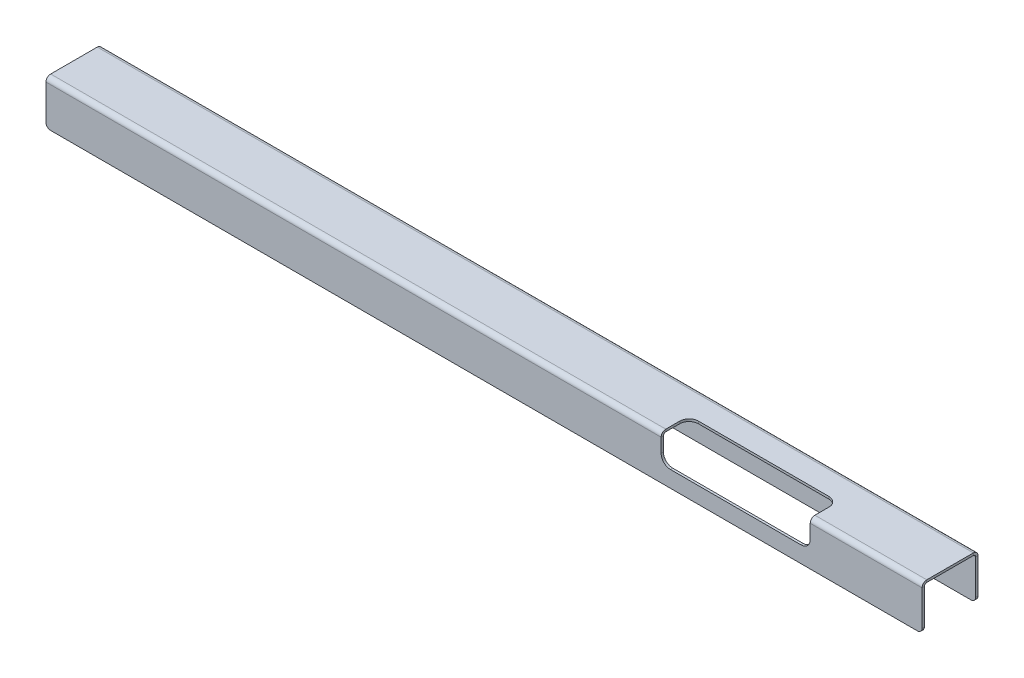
ISO-10303-21;
HEADER;
FILE_DESCRIPTION(('STEP AP214'),'2;1');
FILE_NAME('part.step','',(''),(''),'','','');
FILE_SCHEMA(('AUTOMOTIVE_DESIGN { 1 0 10303 214 1 1 1 1 }'));
ENDSEC;
DATA;
#1=APPLICATION_CONTEXT('core data for automotive mechanical design processes');
#2=APPLICATION_PROTOCOL_DEFINITION('international standard','automotive_design',2000,#1);
#3=PRODUCT_CONTEXT('',#1,'mechanical');
#4=PRODUCT('Part','Part','',(#3));
#5=PRODUCT_RELATED_PRODUCT_CATEGORY('part','',(#4));
#6=PRODUCT_DEFINITION_FORMATION('','',#4);
#7=PRODUCT_DEFINITION_CONTEXT('part definition',#1,'design');
#8=PRODUCT_DEFINITION('design','',#6,#7);
#9=PRODUCT_DEFINITION_SHAPE('','',#8);
#10=(LENGTH_UNIT() NAMED_UNIT(*) SI_UNIT(.MILLI.,.METRE.));
#11=(NAMED_UNIT(*) PLANE_ANGLE_UNIT() SI_UNIT($,.RADIAN.));
#12=(NAMED_UNIT(*) SI_UNIT($,.STERADIAN.) SOLID_ANGLE_UNIT());
#13=UNCERTAINTY_MEASURE_WITH_UNIT(LENGTH_MEASURE(1.E-05),#10,'distance_accuracy_value','');
#14=(GEOMETRIC_REPRESENTATION_CONTEXT(3) GLOBAL_UNCERTAINTY_ASSIGNED_CONTEXT((#13)) GLOBAL_UNIT_ASSIGNED_CONTEXT((#10,
#11,#12)) REPRESENTATION_CONTEXT('',''));
#15=CARTESIAN_POINT('',(0.,0.,0.));
#16=DIRECTION('',(0.,0.,1.));
#17=DIRECTION('',(1.,0.,0.));
#18=AXIS2_PLACEMENT_3D('',#15,#16,#17);
#19=CARTESIAN_POINT('',(419.1,30.1625000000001,19.05));
#20=DIRECTION('',(-1.,0.,0.));
#21=DIRECTION('',(0.,0.,1.));
#22=AXIS2_PLACEMENT_3D('',#19,#20,#21);
#23=PLANE('',#22);
#24=DIRECTION('',(0.,-1.,0.));
#25=VECTOR('',#24,1.);
#26=CARTESIAN_POINT('',(419.1,30.1625000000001,38.1));
#27=LINE('',#26,#25);
#28=CARTESIAN_POINT('',(419.1,26.9875000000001,38.1));
#29=VERTEX_POINT('',#28);
#30=CARTESIAN_POINT('',(419.1,17.4625000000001,38.1));
#31=VERTEX_POINT('',#30);
#32=EDGE_CURVE('E676',#29,#31,#27,.T.);
#33=ORIENTED_EDGE('',*,*,#32,.T.);
#34=DIRECTION('',(0.,0.,1.));
#35=VECTOR('',#34,1.);
#36=CARTESIAN_POINT('',(419.1,17.4625000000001,36.5125000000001));
#37=LINE('',#36,#35);
#38=CARTESIAN_POINT('',(419.1,17.4625000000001,36.5125000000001));
#39=VERTEX_POINT('',#38);
#40=EDGE_CURVE('E463',#31,#39,#37,.F.);
#41=ORIENTED_EDGE('',*,*,#40,.T.);
#42=DIRECTION('',(0.,1.,0.));
#43=VECTOR('',#42,1.);
#44=CARTESIAN_POINT('',(419.1,2.62722613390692E-13,36.5125000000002));
#45=LINE('',#44,#43);
#46=CARTESIAN_POINT('',(419.1,26.9875000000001,36.5125));
#47=VERTEX_POINT('',#46);
#48=EDGE_CURVE('E418',#39,#47,#45,.T.);
#49=ORIENTED_EDGE('',*,*,#48,.T.);
#50=DIRECTION('',(0.,0.,1.));
#51=VECTOR('',#50,1.);
#52=CARTESIAN_POINT('',(419.1,26.9875000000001,36.5125));
#53=LINE('',#52,#51);
#54=EDGE_CURVE('E282',#47,#29,#53,.T.);
#55=ORIENTED_EDGE('',*,*,#54,.T.);
#56=EDGE_LOOP('',(#33,#41,#49,#55));
#57=FACE_BOUND('',#56,.T.);
#58=ADVANCED_FACE('F70',(#57),#23,.F.);
#59=DIRECTION('',(0.,0.,-1.));
#60=VECTOR('',#59,1.);
#61=CARTESIAN_POINT('',(419.1,28.575,-1.00463116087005E-13));
#62=LINE('',#61,#60);
#63=CARTESIAN_POINT('',(419.1,28.5750000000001,34.925));
#64=VERTEX_POINT('',#63);
#65=CARTESIAN_POINT('',(419.1,28.5750000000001,25.4));
#66=VERTEX_POINT('',#65);
#67=EDGE_CURVE('E295',#64,#66,#62,.T.);
#68=ORIENTED_EDGE('',*,*,#67,.T.);
#69=DIRECTION('',(0.,-1.,0.));
#70=VECTOR('',#69,1.);
#71=CARTESIAN_POINT('',(419.1,30.1625000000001,25.4));
#72=LINE('',#71,#70);
#73=CARTESIAN_POINT('',(419.1,30.1625000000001,25.4));
#74=VERTEX_POINT('',#73);
#75=EDGE_CURVE('E264',#66,#74,#72,.F.);
#76=ORIENTED_EDGE('',*,*,#75,.T.);
#77=DIRECTION('',(0.,0.,1.));
#78=VECTOR('',#77,1.);
#79=CARTESIAN_POINT('',(419.1,30.1625000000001,19.05));
#80=LINE('',#79,#78);
#81=CARTESIAN_POINT('',(419.1,30.1625000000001,34.925));
#82=VERTEX_POINT('',#81);
#83=EDGE_CURVE('E257',#74,#82,#80,.T.);
#84=ORIENTED_EDGE('',*,*,#83,.T.);
#85=DIRECTION('',(0.,-1.,0.));
#86=VECTOR('',#85,1.);
#87=CARTESIAN_POINT('',(419.1,30.1625000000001,34.925));
#88=LINE('',#87,#86);
#89=EDGE_CURVE('E261',#82,#64,#88,.T.);
#90=ORIENTED_EDGE('',*,*,#89,.T.);
#91=EDGE_LOOP('',(#68,#76,#84,#90));
#92=FACE_BOUND('',#91,.T.);
#93=ADVANCED_FACE('F260',(#92),#23,.F.);
#94=CARTESIAN_POINT('',(520.7,30.1625000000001,19.05));
#95=DIRECTION('',(1.,0.,0.));
#96=DIRECTION('',(0.,0.,-1.));
#97=AXIS2_PLACEMENT_3D('',#94,#95,#96);
#98=PLANE('',#97);
#99=DIRECTION('',(0.,0.,1.));
#100=VECTOR('',#99,1.);
#101=CARTESIAN_POINT('',(520.7,30.1625000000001,19.05));
#102=LINE('',#101,#100);
#103=CARTESIAN_POINT('',(520.7,30.1625000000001,25.4));
#104=VERTEX_POINT('',#103);
#105=CARTESIAN_POINT('',(520.7,30.1625000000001,34.925));
#106=VERTEX_POINT('',#105);
#107=EDGE_CURVE('E270',#104,#106,#102,.T.);
#108=ORIENTED_EDGE('',*,*,#107,.F.);
#109=DIRECTION('',(0.,1.,0.));
#110=VECTOR('',#109,1.);
#111=CARTESIAN_POINT('',(520.7,28.5750000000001,25.4));
#112=LINE('',#111,#110);
#113=CARTESIAN_POINT('',(520.7,28.5750000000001,25.4));
#114=VERTEX_POINT('',#113);
#115=EDGE_CURVE('E460',#104,#114,#112,.F.);
#116=ORIENTED_EDGE('',*,*,#115,.T.);
#117=DIRECTION('',(0.,0.,1.));
#118=VECTOR('',#117,1.);
#119=CARTESIAN_POINT('',(520.7,28.575,-1.00463116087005E-13));
#120=LINE('',#119,#118);
#121=CARTESIAN_POINT('',(520.7,28.5750000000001,34.925));
#122=VERTEX_POINT('',#121);
#123=EDGE_CURVE('E594',#114,#122,#120,.T.);
#124=ORIENTED_EDGE('',*,*,#123,.T.);
#125=DIRECTION('',(0.,1.,0.));
#126=VECTOR('',#125,1.);
#127=CARTESIAN_POINT('',(520.7,28.5750000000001,34.925));
#128=LINE('',#127,#126);
#129=EDGE_CURVE('E283',#122,#106,#128,.T.);
#130=ORIENTED_EDGE('',*,*,#129,.T.);
#131=EDGE_LOOP('',(#108,#116,#124,#130));
#132=FACE_BOUND('',#131,.T.);
#133=ADVANCED_FACE('F648',(#132),#98,.F.);
#134=DIRECTION('',(0.,-1.,0.));
#135=VECTOR('',#134,1.);
#136=CARTESIAN_POINT('',(520.7,2.62722613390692E-13,36.5125000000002));
#137=LINE('',#136,#135);
#138=CARTESIAN_POINT('',(520.7,26.9875000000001,36.5125));
#139=VERTEX_POINT('',#138);
#140=CARTESIAN_POINT('',(520.7,17.4625000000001,36.5125000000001));
#141=VERTEX_POINT('',#140);
#142=EDGE_CURVE('E425',#139,#141,#137,.T.);
#143=ORIENTED_EDGE('',*,*,#142,.T.);
#144=DIRECTION('',(0.,0.,1.));
#145=VECTOR('',#144,1.);
#146=CARTESIAN_POINT('',(520.7,17.4625000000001,38.1));
#147=LINE('',#146,#145);
#148=CARTESIAN_POINT('',(520.7,17.4625000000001,38.1));
#149=VERTEX_POINT('',#148);
#150=EDGE_CURVE('E441',#141,#149,#147,.T.);
#151=ORIENTED_EDGE('',*,*,#150,.T.);
#152=DIRECTION('',(0.,1.,0.));
#153=VECTOR('',#152,1.);
#154=CARTESIAN_POINT('',(520.7,30.1625000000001,38.1));
#155=LINE('',#154,#153);
#156=CARTESIAN_POINT('',(520.7,26.9875000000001,38.1));
#157=VERTEX_POINT('',#156);
#158=EDGE_CURVE('E684',#149,#157,#155,.T.);
#159=ORIENTED_EDGE('',*,*,#158,.T.);
#160=DIRECTION('',(0.,0.,-1.));
#161=VECTOR('',#160,1.);
#162=CARTESIAN_POINT('',(520.7,26.9875000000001,38.1));
#163=LINE('',#162,#161);
#164=EDGE_CURVE('E433',#157,#139,#163,.T.);
#165=ORIENTED_EDGE('',*,*,#164,.T.);
#166=EDGE_LOOP('',(#143,#151,#159,#165));
#167=FACE_BOUND('',#166,.T.);
#168=ADVANCED_FACE('F667',(#167),#98,.F.);
#169=CARTESIAN_POINT('',(0.,26.9875000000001,34.925));
#170=DIRECTION('',(-1.,0.,0.));
#171=DIRECTION('',(0.,0.,1.));
#172=AXIS2_PLACEMENT_3D('',#169,#170,#171);
#173=CYLINDRICAL_SURFACE('',#172,3.175);
#174=CARTESIAN_POINT('',(520.7,26.9875000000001,34.925));
#175=DIRECTION('',(1.,0.,0.));
#176=DIRECTION('',(0.,0.,-1.));
#177=AXIS2_PLACEMENT_3D('',#174,#175,#176);
#178=CIRCLE('',#177,3.175);
#179=EDGE_CURVE('E590',#157,#106,#178,.F.);
#180=ORIENTED_EDGE('',*,*,#179,.F.);
#181=DIRECTION('',(-1.,0.,0.));
#182=VECTOR('',#181,1.);
#183=CARTESIAN_POINT('',(596.9,26.9875000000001,38.1));
#184=LINE('',#183,#182);
#185=CARTESIAN_POINT('',(596.9,26.9875000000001,38.1));
#186=VERTEX_POINT('',#185);
#187=EDGE_CURVE('E575',#157,#186,#184,.F.);
#188=ORIENTED_EDGE('',*,*,#187,.T.);
#189=CARTESIAN_POINT('',(596.9,26.9875000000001,34.925));
#190=DIRECTION('',(-1.,0.,0.));
#191=DIRECTION('',(0.,0.,1.));
#192=AXIS2_PLACEMENT_3D('',#189,#190,#191);
#193=CIRCLE('',#192,3.175);
#194=CARTESIAN_POINT('',(596.9,30.1625000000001,34.925));
#195=VERTEX_POINT('',#194);
#196=EDGE_CURVE('E304',#195,#186,#193,.F.);
#197=ORIENTED_EDGE('',*,*,#196,.F.);
#198=DIRECTION('',(-1.,0.,0.));
#199=VECTOR('',#198,1.);
#200=CARTESIAN_POINT('',(0.,30.1625000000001,34.925));
#201=LINE('',#200,#199);
#202=EDGE_CURVE('E305',#106,#195,#201,.F.);
#203=ORIENTED_EDGE('',*,*,#202,.F.);
#204=EDGE_LOOP('',(#180,#188,#197,#203));
#205=FACE_BOUND('',#204,.T.);
#206=ADVANCED_FACE('F736',(#205),#173,.T.);
#207=CARTESIAN_POINT('',(0.,26.9875000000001,34.925));
#208=DIRECTION('',(-1.,0.,0.));
#209=DIRECTION('',(0.,0.,1.));
#210=AXIS2_PLACEMENT_3D('',#207,#208,#209);
#211=CYLINDRICAL_SURFACE('',#210,1.5875);
#212=DIRECTION('',(-1.,0.,0.));
#213=VECTOR('',#212,1.);
#214=CARTESIAN_POINT('',(596.9,26.9875000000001,36.5125));
#215=LINE('',#214,#213);
#216=CARTESIAN_POINT('',(596.9,26.9875000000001,36.5125));
#217=VERTEX_POINT('',#216);
#218=EDGE_CURVE('E555',#217,#139,#215,.T.);
#219=ORIENTED_EDGE('',*,*,#218,.T.);
#220=CARTESIAN_POINT('',(520.7,26.9875000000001,34.925));
#221=DIRECTION('',(1.,0.,0.));
#222=DIRECTION('',(0.,0.,-1.));
#223=AXIS2_PLACEMENT_3D('',#220,#221,#222);
#224=CIRCLE('',#223,1.5875);
#225=EDGE_CURVE('E294',#139,#122,#224,.F.);
#226=ORIENTED_EDGE('',*,*,#225,.T.);
#227=DIRECTION('',(-1.,0.,0.));
#228=VECTOR('',#227,1.);
#229=CARTESIAN_POINT('',(0.,28.5750000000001,34.925));
#230=LINE('',#229,#228);
#231=CARTESIAN_POINT('',(596.9,28.5750000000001,34.925));
#232=VERTEX_POINT('',#231);
#233=EDGE_CURVE('E328',#122,#232,#230,.F.);
#234=ORIENTED_EDGE('',*,*,#233,.T.);
#235=CARTESIAN_POINT('',(596.9,26.9875000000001,34.925));
#236=DIRECTION('',(-1.,0.,0.));
#237=DIRECTION('',(0.,0.,1.));
#238=AXIS2_PLACEMENT_3D('',#235,#236,#237);
#239=CIRCLE('',#238,1.5875);
#240=EDGE_CURVE('E320',#232,#217,#239,.F.);
#241=ORIENTED_EDGE('',*,*,#240,.T.);
#242=EDGE_LOOP('',(#219,#226,#234,#241));
#243=FACE_BOUND('',#242,.T.);
#244=ADVANCED_FACE('F726',(#243),#211,.F.);
#245=CARTESIAN_POINT('',(0.,30.1625000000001,38.1));
#246=DIRECTION('',(1.,0.,0.));
#247=DIRECTION('',(0.,0.,-1.));
#248=AXIS2_PLACEMENT_3D('',#245,#246,#247);
#249=PLANE('',#248);
#250=DIRECTION('',(0.,1.,0.));
#251=VECTOR('',#250,1.);
#252=CARTESIAN_POINT('',(0.,28.5750000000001,34.925));
#253=LINE('',#252,#251);
#254=CARTESIAN_POINT('',(0.,28.5750000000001,34.925));
#255=VERTEX_POINT('',#254);
#256=CARTESIAN_POINT('',(0.,30.1625000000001,34.925));
#257=VERTEX_POINT('',#256);
#258=EDGE_CURVE('E311',#255,#257,#253,.T.);
#259=ORIENTED_EDGE('',*,*,#258,.T.);
#260=DIRECTION('',(0.,0.,1.));
#261=VECTOR('',#260,1.);
#262=CARTESIAN_POINT('',(0.,30.1625000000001,38.1));
#263=LINE('',#262,#261);
#264=CARTESIAN_POINT('',(0.,30.1625,3.17499999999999));
#265=VERTEX_POINT('',#264);
#266=EDGE_CURVE('E301',#265,#257,#263,.T.);
#267=ORIENTED_EDGE('',*,*,#266,.F.);
#268=DIRECTION('',(0.,1.,0.));
#269=VECTOR('',#268,1.);
#270=CARTESIAN_POINT('',(0.,28.575,3.175));
#271=LINE('',#270,#269);
#272=CARTESIAN_POINT('',(0.,28.575,3.175));
#273=VERTEX_POINT('',#272);
#274=EDGE_CURVE('E344',#273,#265,#271,.T.);
#275=ORIENTED_EDGE('',*,*,#274,.F.);
#276=DIRECTION('',(0.,0.,1.));
#277=VECTOR('',#276,1.);
#278=CARTESIAN_POINT('',(0.,28.5750000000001,38.1));
#279=LINE('',#278,#277);
#280=EDGE_CURVE('E355',#273,#255,#279,.T.);
#281=ORIENTED_EDGE('',*,*,#280,.T.);
#282=EDGE_LOOP('',(#259,#267,#275,#281));
#283=FACE_BOUND('',#282,.T.);
#284=ADVANCED_FACE('F772',(#283),#249,.F.);
#285=CARTESIAN_POINT('',(596.9,30.1625,1.58749999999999));
#286=DIRECTION('',(-1.,0.,0.));
#287=DIRECTION('',(0.,0.,1.));
#288=AXIS2_PLACEMENT_3D('',#285,#286,#287);
#289=PLANE('',#288);
#290=DIRECTION('',(0.,1.,0.));
#291=VECTOR('',#290,1.);
#292=CARTESIAN_POINT('',(596.9,28.5750000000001,34.925));
#293=LINE('',#292,#291);
#294=EDGE_CURVE('E334',#232,#195,#293,.T.);
#295=ORIENTED_EDGE('',*,*,#294,.F.);
#296=DIRECTION('',(0.,0.,-1.));
#297=VECTOR('',#296,1.);
#298=CARTESIAN_POINT('',(596.9,28.575,1.5875));
#299=LINE('',#298,#297);
#300=CARTESIAN_POINT('',(596.9,28.575,3.175));
#301=VERTEX_POINT('',#300);
#302=EDGE_CURVE('E359',#232,#301,#299,.T.);
#303=ORIENTED_EDGE('',*,*,#302,.T.);
#304=DIRECTION('',(0.,1.,0.));
#305=VECTOR('',#304,1.);
#306=CARTESIAN_POINT('',(596.9,28.575,3.17499999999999));
#307=LINE('',#306,#305);
#308=CARTESIAN_POINT('',(596.9,30.1625,3.17499999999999));
#309=VERTEX_POINT('',#308);
#310=EDGE_CURVE('E338',#301,#309,#307,.T.);
#311=ORIENTED_EDGE('',*,*,#310,.T.);
#312=DIRECTION('',(0.,0.,-1.));
#313=VECTOR('',#312,1.);
#314=CARTESIAN_POINT('',(596.9,30.1625,1.58749999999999));
#315=LINE('',#314,#313);
#316=EDGE_CURVE('E358',#195,#309,#315,.T.);
#317=ORIENTED_EDGE('',*,*,#316,.F.);
#318=EDGE_LOOP('',(#295,#303,#311,#317));
#319=FACE_BOUND('',#318,.T.);
#320=ADVANCED_FACE('F729',(#319),#289,.F.);
#321=CARTESIAN_POINT('',(0.,30.1625,-1.06005842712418E-13));
#322=DIRECTION('',(0.,-1.,0.));
#323=DIRECTION('',(0.,0.,-1.));
#324=AXIS2_PLACEMENT_3D('',#321,#322,#323);
#325=PLANE('',#324);
#326=DIRECTION('',(-1.,0.,0.));
#327=VECTOR('',#326,1.);
#328=CARTESIAN_POINT('',(520.7,30.1625000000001,19.05));
#329=LINE('',#328,#327);
#330=CARTESIAN_POINT('',(514.35,30.1625000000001,19.05));
#331=VERTEX_POINT('',#330);
#332=CARTESIAN_POINT('',(425.45,30.1625000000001,19.05));
#333=VERTEX_POINT('',#332);
#334=EDGE_CURVE('E675',#331,#333,#329,.T.);
#335=ORIENTED_EDGE('',*,*,#334,.F.);
#336=CARTESIAN_POINT('',(514.35,30.1625000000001,25.4));
#337=DIRECTION('',(0.,-1.,0.));
#338=DIRECTION('',(0.,0.,-1.));
#339=AXIS2_PLACEMENT_3D('',#336,#337,#338);
#340=CIRCLE('',#339,6.35);
#341=EDGE_CURVE('E474',#331,#104,#340,.T.);
#342=ORIENTED_EDGE('',*,*,#341,.T.);
#343=ORIENTED_EDGE('',*,*,#107,.T.);
#344=ORIENTED_EDGE('',*,*,#202,.T.);
#345=ORIENTED_EDGE('',*,*,#316,.T.);
#346=DIRECTION('',(1.,0.,0.));
#347=VECTOR('',#346,1.);
#348=CARTESIAN_POINT('',(0.,30.1625,3.17499999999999));
#349=LINE('',#348,#347);
#350=EDGE_CURVE('E348',#265,#309,#349,.T.);
#351=ORIENTED_EDGE('',*,*,#350,.F.);
#352=ORIENTED_EDGE('',*,*,#266,.T.);
#353=EDGE_CURVE('E289',#257,#82,#201,.F.);
#354=ORIENTED_EDGE('',*,*,#353,.T.);
#355=ORIENTED_EDGE('',*,*,#83,.F.);
#356=CARTESIAN_POINT('',(425.45,30.1625000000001,25.4));
#357=DIRECTION('',(0.,-1.,0.));
#358=DIRECTION('',(0.,0.,-1.));
#359=AXIS2_PLACEMENT_3D('',#356,#357,#358);
#360=CIRCLE('',#359,6.35);
#361=EDGE_CURVE('E489',#74,#333,#360,.T.);
#362=ORIENTED_EDGE('',*,*,#361,.T.);
#363=EDGE_LOOP('',(#335,#342,#343,#344,#345,#351,#352,#354,#355,#362));
#364=FACE_BOUND('',#363,.T.);
#365=ADVANCED_FACE('F298',(#364),#325,.F.);
#366=CARTESIAN_POINT('',(0.,28.575,-1.00463116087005E-13));
#367=DIRECTION('',(0.,-1.,0.));
#368=DIRECTION('',(0.,0.,-1.));
#369=AXIS2_PLACEMENT_3D('',#366,#367,#368);
#370=PLANE('',#369);
#371=ORIENTED_EDGE('',*,*,#123,.F.);
#372=CARTESIAN_POINT('',(514.35,28.5750000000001,25.4));
#373=DIRECTION('',(0.,-1.,0.));
#374=DIRECTION('',(0.,0.,-1.));
#375=AXIS2_PLACEMENT_3D('',#372,#373,#374);
#376=CIRCLE('',#375,6.35);
#377=CARTESIAN_POINT('',(514.35,28.5750000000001,19.05));
#378=VERTEX_POINT('',#377);
#379=EDGE_CURVE('E477',#114,#378,#376,.F.);
#380=ORIENTED_EDGE('',*,*,#379,.T.);
#381=DIRECTION('',(1.,0.,0.));
#382=VECTOR('',#381,1.);
#383=CARTESIAN_POINT('',(0.,28.5750000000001,19.05));
#384=LINE('',#383,#382);
#385=CARTESIAN_POINT('',(425.45,28.5750000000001,19.05));
#386=VERTEX_POINT('',#385);
#387=EDGE_CURVE('E429',#386,#378,#384,.T.);
#388=ORIENTED_EDGE('',*,*,#387,.F.);
#389=CARTESIAN_POINT('',(425.45,28.5750000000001,25.4));
#390=DIRECTION('',(0.,-1.,0.));
#391=DIRECTION('',(0.,0.,-1.));
#392=AXIS2_PLACEMENT_3D('',#389,#390,#391);
#393=CIRCLE('',#392,6.35);
#394=EDGE_CURVE('E486',#386,#66,#393,.F.);
#395=ORIENTED_EDGE('',*,*,#394,.T.);
#396=ORIENTED_EDGE('',*,*,#67,.F.);
#397=EDGE_CURVE('E324',#255,#64,#230,.F.);
#398=ORIENTED_EDGE('',*,*,#397,.F.);
#399=ORIENTED_EDGE('',*,*,#280,.F.);
#400=DIRECTION('',(-1.,0.,0.));
#401=VECTOR('',#400,1.);
#402=CARTESIAN_POINT('',(596.9,28.575,3.17499999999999));
#403=LINE('',#402,#401);
#404=EDGE_CURVE('E341',#301,#273,#403,.T.);
#405=ORIENTED_EDGE('',*,*,#404,.F.);
#406=ORIENTED_EDGE('',*,*,#302,.F.);
#407=ORIENTED_EDGE('',*,*,#233,.F.);
#408=EDGE_LOOP('',(#371,#380,#388,#395,#396,#398,#399,#405,#406,#407));
#409=FACE_BOUND('',#408,.T.);
#410=ADVANCED_FACE('F707',(#409),#370,.T.);
#411=CARTESIAN_POINT('',(625.519063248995,0.,1.5875));
#412=DIRECTION('',(0.,0.,-1.));
#413=DIRECTION('',(-1.,0.,0.));
#414=AXIS2_PLACEMENT_3D('',#411,#412,#413);
#415=PLANE('',#414);
#416=DIRECTION('',(0.,1.,0.));
#417=VECTOR('',#416,1.);
#418=CARTESIAN_POINT('',(0.,0.,1.5875));
#419=LINE('',#418,#417);
#420=CARTESIAN_POINT('',(0.,26.9875,1.5875));
#421=VERTEX_POINT('',#420);
#422=CARTESIAN_POINT('',(0.,3.175,1.5875));
#423=VERTEX_POINT('',#422);
#424=EDGE_CURVE('E402',#421,#423,#419,.F.);
#425=ORIENTED_EDGE('',*,*,#424,.T.);
#426=CARTESIAN_POINT('',(3.175,3.175,1.5875));
#427=DIRECTION('',(0.,0.,-1.));
#428=DIRECTION('',(-1.,0.,0.));
#429=AXIS2_PLACEMENT_3D('',#426,#427,#428);
#430=CIRCLE('',#429,3.175);
#431=CARTESIAN_POINT('',(3.17500000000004,0.,1.5875));
#432=VERTEX_POINT('',#431);
#433=EDGE_CURVE('E521',#423,#432,#430,.F.);
#434=ORIENTED_EDGE('',*,*,#433,.T.);
#435=DIRECTION('',(-1.,0.,0.));
#436=VECTOR('',#435,1.);
#437=CARTESIAN_POINT('',(625.519063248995,0.,1.5875));
#438=LINE('',#437,#436);
#439=CARTESIAN_POINT('',(593.725,0.,1.5875));
#440=VERTEX_POINT('',#439);
#441=EDGE_CURVE('E415',#440,#432,#438,.T.);
#442=ORIENTED_EDGE('',*,*,#441,.F.);
#443=CARTESIAN_POINT('',(593.725,3.175,1.5875));
#444=DIRECTION('',(0.,0.,-1.));
#445=DIRECTION('',(-1.,0.,0.));
#446=AXIS2_PLACEMENT_3D('',#443,#444,#445);
#447=CIRCLE('',#446,3.175);
#448=CARTESIAN_POINT('',(596.9,3.175,1.5875));
#449=VERTEX_POINT('',#448);
#450=EDGE_CURVE('E518',#440,#449,#447,.F.);
#451=ORIENTED_EDGE('',*,*,#450,.T.);
#452=DIRECTION('',(0.,1.,0.));
#453=VECTOR('',#452,1.);
#454=CARTESIAN_POINT('',(596.9,0.,1.5875));
#455=LINE('',#454,#453);
#456=CARTESIAN_POINT('',(596.9,26.9875,1.5875));
#457=VERTEX_POINT('',#456);
#458=EDGE_CURVE('E399',#457,#449,#455,.F.);
#459=ORIENTED_EDGE('',*,*,#458,.F.);
#460=DIRECTION('',(-1.,0.,0.));
#461=VECTOR('',#460,1.);
#462=CARTESIAN_POINT('',(0.,26.9875,1.5875));
#463=LINE('',#462,#461);
#464=EDGE_CURVE('E385',#421,#457,#463,.F.);
#465=ORIENTED_EDGE('',*,*,#464,.F.);
#466=EDGE_LOOP('',(#425,#434,#442,#451,#459,#465));
#467=FACE_BOUND('',#466,.T.);
#468=ADVANCED_FACE('F766',(#467),#415,.F.);
#469=CARTESIAN_POINT('',(625.519063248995,0.,0.));
#470=DIRECTION('',(0.,0.,-1.));
#471=DIRECTION('',(-1.,0.,0.));
#472=AXIS2_PLACEMENT_3D('',#469,#470,#471);
#473=PLANE('',#472);
#474=DIRECTION('',(-1.,0.,0.));
#475=VECTOR('',#474,1.);
#476=CARTESIAN_POINT('',(625.519063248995,0.,0.));
#477=LINE('',#476,#475);
#478=CARTESIAN_POINT('',(593.725,0.,0.));
#479=VERTEX_POINT('',#478);
#480=CARTESIAN_POINT('',(3.17500000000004,0.,0.));
#481=VERTEX_POINT('',#480);
#482=EDGE_CURVE('E412',#479,#481,#477,.T.);
#483=ORIENTED_EDGE('',*,*,#482,.T.);
#484=CARTESIAN_POINT('',(3.175,3.175,0.));
#485=DIRECTION('',(0.,0.,-1.));
#486=DIRECTION('',(-1.,0.,0.));
#487=AXIS2_PLACEMENT_3D('',#484,#485,#486);
#488=CIRCLE('',#487,3.175);
#489=CARTESIAN_POINT('',(0.,3.175,0.));
#490=VERTEX_POINT('',#489);
#491=EDGE_CURVE('E533',#481,#490,#488,.T.);
#492=ORIENTED_EDGE('',*,*,#491,.T.);
#493=DIRECTION('',(0.,-1.,0.));
#494=VECTOR('',#493,1.);
#495=CARTESIAN_POINT('',(0.,0.,0.));
#496=LINE('',#495,#494);
#497=CARTESIAN_POINT('',(0.,26.9875,0.));
#498=VERTEX_POINT('',#497);
#499=EDGE_CURVE('E408',#498,#490,#496,.T.);
#500=ORIENTED_EDGE('',*,*,#499,.F.);
#501=DIRECTION('',(-1.,0.,0.));
#502=VECTOR('',#501,1.);
#503=CARTESIAN_POINT('',(0.,26.9875,0.));
#504=LINE('',#503,#502);
#505=CARTESIAN_POINT('',(596.9,26.9875,0.));
#506=VERTEX_POINT('',#505);
#507=EDGE_CURVE('E368',#498,#506,#504,.F.);
#508=ORIENTED_EDGE('',*,*,#507,.T.);
#509=DIRECTION('',(0.,-1.,0.));
#510=VECTOR('',#509,1.);
#511=CARTESIAN_POINT('',(596.9,0.,0.));
#512=LINE('',#511,#510);
#513=CARTESIAN_POINT('',(596.9,3.175,0.));
#514=VERTEX_POINT('',#513);
#515=EDGE_CURVE('E395',#506,#514,#512,.T.);
#516=ORIENTED_EDGE('',*,*,#515,.T.);
#517=CARTESIAN_POINT('',(593.725,3.175,0.));
#518=DIRECTION('',(0.,0.,-1.));
#519=DIRECTION('',(-1.,0.,0.));
#520=AXIS2_PLACEMENT_3D('',#517,#518,#519);
#521=CIRCLE('',#520,3.175);
#522=EDGE_CURVE('E530',#514,#479,#521,.T.);
#523=ORIENTED_EDGE('',*,*,#522,.T.);
#524=EDGE_LOOP('',(#483,#492,#500,#508,#516,#523));
#525=FACE_BOUND('',#524,.T.);
#526=ADVANCED_FACE('F755',(#525),#473,.T.);
#527=CARTESIAN_POINT('',(0.,0.,0.));
#528=DIRECTION('',(1.,0.,0.));
#529=DIRECTION('',(0.,0.,-1.));
#530=AXIS2_PLACEMENT_3D('',#527,#528,#529);
#531=PLANE('',#530);
#532=ORIENTED_EDGE('',*,*,#499,.T.);
#533=DIRECTION('',(0.,0.,1.));
#534=VECTOR('',#533,1.);
#535=CARTESIAN_POINT('',(0.,3.175,1.5875));
#536=LINE('',#535,#534);
#537=EDGE_CURVE('E514',#490,#423,#536,.T.);
#538=ORIENTED_EDGE('',*,*,#537,.T.);
#539=ORIENTED_EDGE('',*,*,#424,.F.);
#540=DIRECTION('',(0.,0.,-1.));
#541=VECTOR('',#540,1.);
#542=CARTESIAN_POINT('',(0.,26.9875,1.5875));
#543=LINE('',#542,#541);
#544=EDGE_CURVE('E377',#421,#498,#543,.T.);
#545=ORIENTED_EDGE('',*,*,#544,.T.);
#546=EDGE_LOOP('',(#532,#538,#539,#545));
#547=FACE_BOUND('',#546,.T.);
#548=ADVANCED_FACE('F762',(#547),#531,.F.);
#549=CARTESIAN_POINT('',(625.519063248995,0.,0.));
#550=DIRECTION('',(0.,-1.,0.));
#551=DIRECTION('',(0.,0.,-1.));
#552=AXIS2_PLACEMENT_3D('',#549,#550,#551);
#553=PLANE('',#552);
#554=ORIENTED_EDGE('',*,*,#441,.T.);
#555=DIRECTION('',(0.,0.,1.));
#556=VECTOR('',#555,1.);
#557=CARTESIAN_POINT('',(3.175,0.,0.));
#558=LINE('',#557,#556);
#559=EDGE_CURVE('E92',#432,#481,#558,.F.);
#560=ORIENTED_EDGE('',*,*,#559,.T.);
#561=ORIENTED_EDGE('',*,*,#482,.F.);
#562=DIRECTION('',(0.,0.,1.));
#563=VECTOR('',#562,1.);
#564=CARTESIAN_POINT('',(593.725,0.,0.));
#565=LINE('',#564,#563);
#566=EDGE_CURVE('E524',#479,#440,#565,.T.);
#567=ORIENTED_EDGE('',*,*,#566,.T.);
#568=EDGE_LOOP('',(#554,#560,#561,#567));
#569=FACE_BOUND('',#568,.T.);
#570=ADVANCED_FACE('F792',(#569),#553,.T.);
#571=CARTESIAN_POINT('',(596.9,0.,0.));
#572=DIRECTION('',(1.,0.,0.));
#573=DIRECTION('',(0.,-1.,0.));
#574=AXIS2_PLACEMENT_3D('',#571,#572,#573);
#575=PLANE('',#574);
#576=ORIENTED_EDGE('',*,*,#458,.T.);
#577=DIRECTION('',(0.,0.,1.));
#578=VECTOR('',#577,1.);
#579=CARTESIAN_POINT('',(596.9,3.175,0.));
#580=LINE('',#579,#578);
#581=EDGE_CURVE('E13',#449,#514,#580,.F.);
#582=ORIENTED_EDGE('',*,*,#581,.T.);
#583=ORIENTED_EDGE('',*,*,#515,.F.);
#584=DIRECTION('',(0.,0.,-1.));
#585=VECTOR('',#584,1.);
#586=CARTESIAN_POINT('',(596.9,26.9875,1.5875));
#587=LINE('',#586,#585);
#588=EDGE_CURVE('E391',#457,#506,#587,.T.);
#589=ORIENTED_EDGE('',*,*,#588,.F.);
#590=EDGE_LOOP('',(#576,#582,#583,#589));
#591=FACE_BOUND('',#590,.T.);
#592=ADVANCED_FACE('F751',(#591),#575,.T.);
#593=CARTESIAN_POINT('',(596.9,26.9875,3.175));
#594=DIRECTION('',(1.,0.,0.));
#595=DIRECTION('',(0.,0.,-1.));
#596=AXIS2_PLACEMENT_3D('',#593,#594,#595);
#597=PLANE('',#596);
#598=ORIENTED_EDGE('',*,*,#310,.F.);
#599=CARTESIAN_POINT('',(596.9,26.9875,3.175));
#600=DIRECTION('',(-1.,0.,0.));
#601=DIRECTION('',(0.,0.,1.));
#602=AXIS2_PLACEMENT_3D('',#599,#600,#601);
#603=CIRCLE('',#602,1.5875);
#604=EDGE_CURVE('E381',#457,#301,#603,.F.);
#605=ORIENTED_EDGE('',*,*,#604,.F.);
#606=ORIENTED_EDGE('',*,*,#588,.T.);
#607=CARTESIAN_POINT('',(596.9,26.9875,3.175));
#608=DIRECTION('',(-1.,0.,0.));
#609=DIRECTION('',(0.,0.,1.));
#610=AXIS2_PLACEMENT_3D('',#607,#608,#609);
#611=CIRCLE('',#610,3.175);
#612=EDGE_CURVE('E372',#506,#309,#611,.F.);
#613=ORIENTED_EDGE('',*,*,#612,.T.);
#614=EDGE_LOOP('',(#598,#605,#606,#613));
#615=FACE_BOUND('',#614,.T.);
#616=ADVANCED_FACE('F747',(#615),#597,.T.);
#617=CARTESIAN_POINT('',(0.,26.9875,3.175));
#618=DIRECTION('',(1.,0.,0.));
#619=DIRECTION('',(0.,0.,-1.));
#620=AXIS2_PLACEMENT_3D('',#617,#618,#619);
#621=PLANE('',#620);
#622=CARTESIAN_POINT('',(0.,26.9875,3.175));
#623=DIRECTION('',(-1.,0.,0.));
#624=DIRECTION('',(0.,0.,1.));
#625=AXIS2_PLACEMENT_3D('',#622,#623,#624);
#626=CIRCLE('',#625,1.5875);
#627=EDGE_CURVE('E362',#273,#421,#626,.T.);
#628=ORIENTED_EDGE('',*,*,#627,.F.);
#629=ORIENTED_EDGE('',*,*,#274,.T.);
#630=CARTESIAN_POINT('',(0.,26.9875,3.175));
#631=DIRECTION('',(-1.,0.,0.));
#632=DIRECTION('',(0.,0.,1.));
#633=AXIS2_PLACEMENT_3D('',#630,#631,#632);
#634=CIRCLE('',#633,3.175);
#635=EDGE_CURVE('E373',#265,#498,#634,.T.);
#636=ORIENTED_EDGE('',*,*,#635,.T.);
#637=ORIENTED_EDGE('',*,*,#544,.F.);
#638=EDGE_LOOP('',(#628,#629,#636,#637));
#639=FACE_BOUND('',#638,.T.);
#640=ADVANCED_FACE('F758',(#639),#621,.F.);
#641=CARTESIAN_POINT('',(0.,26.9875,3.175));
#642=DIRECTION('',(-1.,0.,0.));
#643=DIRECTION('',(0.,1.,0.));
#644=AXIS2_PLACEMENT_3D('',#641,#642,#643);
#645=CYLINDRICAL_SURFACE('',#644,3.175);
#646=ORIENTED_EDGE('',*,*,#507,.F.);
#647=ORIENTED_EDGE('',*,*,#635,.F.);
#648=ORIENTED_EDGE('',*,*,#350,.T.);
#649=ORIENTED_EDGE('',*,*,#612,.F.);
#650=EDGE_LOOP('',(#646,#647,#648,#649));
#651=FACE_BOUND('',#650,.T.);
#652=ADVANCED_FACE('F745',(#651),#645,.T.);
#653=CARTESIAN_POINT('',(0.,26.9875,3.175));
#654=DIRECTION('',(-1.,0.,0.));
#655=DIRECTION('',(0.,1.,0.));
#656=AXIS2_PLACEMENT_3D('',#653,#654,#655);
#657=CYLINDRICAL_SURFACE('',#656,1.5875);
#658=ORIENTED_EDGE('',*,*,#464,.T.);
#659=ORIENTED_EDGE('',*,*,#604,.T.);
#660=ORIENTED_EDGE('',*,*,#404,.T.);
#661=ORIENTED_EDGE('',*,*,#627,.T.);
#662=EDGE_LOOP('',(#658,#659,#660,#661));
#663=FACE_BOUND('',#662,.T.);
#664=ADVANCED_FACE('F769',(#663),#657,.F.);
#665=CARTESIAN_POINT('',(596.9,26.9875000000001,34.925));
#666=DIRECTION('',(1.,0.,0.));
#667=DIRECTION('',(0.,0.,-1.));
#668=AXIS2_PLACEMENT_3D('',#665,#666,#667);
#669=PLANE('',#668);
#670=DIRECTION('',(0.,0.,-1.));
#671=VECTOR('',#670,1.);
#672=CARTESIAN_POINT('',(596.9,26.9875000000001,38.1));
#673=LINE('',#672,#671);
#674=EDGE_CURVE('E315',#217,#186,#673,.F.);
#675=ORIENTED_EDGE('',*,*,#674,.F.);
#676=ORIENTED_EDGE('',*,*,#240,.F.);
#677=ORIENTED_EDGE('',*,*,#294,.T.);
#678=ORIENTED_EDGE('',*,*,#196,.T.);
#679=EDGE_LOOP('',(#675,#676,#677,#678));
#680=FACE_BOUND('',#679,.T.);
#681=ADVANCED_FACE('F733',(#680),#669,.T.);
#682=CARTESIAN_POINT('',(0.,26.9875000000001,34.925));
#683=DIRECTION('',(1.,0.,0.));
#684=DIRECTION('',(0.,0.,-1.));
#685=AXIS2_PLACEMENT_3D('',#682,#683,#684);
#686=PLANE('',#685);
#687=CARTESIAN_POINT('',(0.,26.9875000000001,34.925));
#688=DIRECTION('',(-1.,0.,0.));
#689=DIRECTION('',(0.,0.,1.));
#690=AXIS2_PLACEMENT_3D('',#687,#688,#689);
#691=CIRCLE('',#690,1.5875);
#692=CARTESIAN_POINT('',(0.,26.9875000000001,36.5125));
#693=VERTEX_POINT('',#692);
#694=EDGE_CURVE('E329',#693,#255,#691,.T.);
#695=ORIENTED_EDGE('',*,*,#694,.F.);
#696=DIRECTION('',(0.,0.,-1.));
#697=VECTOR('',#696,1.);
#698=CARTESIAN_POINT('',(0.,26.9875000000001,36.5125));
#699=LINE('',#698,#697);
#700=CARTESIAN_POINT('',(0.,26.9875000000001,38.1));
#701=VERTEX_POINT('',#700);
#702=EDGE_CURVE('E576',#693,#701,#699,.F.);
#703=ORIENTED_EDGE('',*,*,#702,.T.);
#704=CARTESIAN_POINT('',(0.,26.9875000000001,34.925));
#705=DIRECTION('',(-1.,0.,0.));
#706=DIRECTION('',(0.,0.,1.));
#707=AXIS2_PLACEMENT_3D('',#704,#705,#706);
#708=CIRCLE('',#707,3.175);
#709=EDGE_CURVE('E313',#701,#257,#708,.T.);
#710=ORIENTED_EDGE('',*,*,#709,.T.);
#711=ORIENTED_EDGE('',*,*,#258,.F.);
#712=EDGE_LOOP('',(#695,#703,#710,#711));
#713=FACE_BOUND('',#712,.T.);
#714=ADVANCED_FACE('F776',(#713),#686,.F.);
#715=CARTESIAN_POINT('',(419.1,26.9875000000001,34.925));
#716=DIRECTION('',(-1.,0.,0.));
#717=DIRECTION('',(0.,0.,1.));
#718=AXIS2_PLACEMENT_3D('',#715,#716,#717);
#719=CIRCLE('',#718,3.175);
#720=EDGE_CURVE('E277',#82,#29,#719,.F.);
#721=ORIENTED_EDGE('',*,*,#720,.F.);
#722=ORIENTED_EDGE('',*,*,#353,.F.);
#723=ORIENTED_EDGE('',*,*,#709,.F.);
#724=EDGE_CURVE('E292',#701,#29,#184,.F.);
#725=ORIENTED_EDGE('',*,*,#724,.T.);
#726=EDGE_LOOP('',(#721,#722,#723,#725));
#727=FACE_BOUND('',#726,.T.);
#728=ADVANCED_FACE('F288',(#727),#173,.T.);
#729=ORIENTED_EDGE('',*,*,#397,.T.);
#730=CARTESIAN_POINT('',(419.1,26.9875000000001,34.925));
#731=DIRECTION('',(-1.,0.,0.));
#732=DIRECTION('',(0.,0.,1.));
#733=AXIS2_PLACEMENT_3D('',#730,#731,#732);
#734=CIRCLE('',#733,1.5875);
#735=EDGE_CURVE('E269',#64,#47,#734,.F.);
#736=ORIENTED_EDGE('',*,*,#735,.T.);
#737=EDGE_CURVE('E580',#47,#693,#215,.T.);
#738=ORIENTED_EDGE('',*,*,#737,.T.);
#739=ORIENTED_EDGE('',*,*,#694,.T.);
#740=EDGE_LOOP('',(#729,#736,#738,#739));
#741=FACE_BOUND('',#740,.T.);
#742=ADVANCED_FACE('F774',(#741),#211,.F.);
#743=CARTESIAN_POINT('',(0.,1.30442816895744E-13,38.1000000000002));
#744=DIRECTION('',(1.,0.,0.));
#745=DIRECTION('',(0.,0.,-1.));
#746=AXIS2_PLACEMENT_3D('',#743,#744,#745);
#747=PLANE('',#746);
#748=DIRECTION('',(0.,1.,0.));
#749=VECTOR('',#748,1.);
#750=CARTESIAN_POINT('',(0.,1.19263487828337E-13,36.5125000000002));
#751=LINE('',#750,#749);
#752=CARTESIAN_POINT('',(0.,3.17500000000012,36.5125000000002));
#753=VERTEX_POINT('',#752);
#754=EDGE_CURVE('E566',#693,#753,#751,.F.);
#755=ORIENTED_EDGE('',*,*,#754,.T.);
#756=DIRECTION('',(0.,0.,-1.));
#757=VECTOR('',#756,1.);
#758=CARTESIAN_POINT('',(0.,3.17500000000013,38.1000000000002));
#759=LINE('',#758,#757);
#760=CARTESIAN_POINT('',(0.,3.17500000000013,38.1000000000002));
#761=VERTEX_POINT('',#760);
#762=EDGE_CURVE('E505',#753,#761,#759,.F.);
#763=ORIENTED_EDGE('',*,*,#762,.T.);
#764=DIRECTION('',(0.,-1.,0.));
#765=VECTOR('',#764,1.);
#766=CARTESIAN_POINT('',(0.,2.73846624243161E-13,38.1000000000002));
#767=LINE('',#766,#765);
#768=EDGE_CURVE('E557',#701,#761,#767,.T.);
#769=ORIENTED_EDGE('',*,*,#768,.F.);
#770=ORIENTED_EDGE('',*,*,#702,.F.);
#771=EDGE_LOOP('',(#755,#763,#769,#770));
#772=FACE_BOUND('',#771,.T.);
#773=ADVANCED_FACE('F624',(#772),#747,.F.);
#774=CARTESIAN_POINT('',(596.9,28.5750000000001,38.1));
#775=DIRECTION('',(-1.,0.,0.));
#776=DIRECTION('',(0.,0.,1.));
#777=AXIS2_PLACEMENT_3D('',#774,#775,#776);
#778=PLANE('',#777);
#779=DIRECTION('',(0.,1.,0.));
#780=VECTOR('',#779,1.);
#781=CARTESIAN_POINT('',(596.9,2.73846624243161E-13,38.1000000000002));
#782=LINE('',#781,#780);
#783=CARTESIAN_POINT('',(596.9,3.17500000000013,38.1000000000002));
#784=VERTEX_POINT('',#783);
#785=EDGE_CURVE('E333',#784,#186,#782,.T.);
#786=ORIENTED_EDGE('',*,*,#785,.F.);
#787=DIRECTION('',(0.,0.,-1.));
#788=VECTOR('',#787,1.);
#789=CARTESIAN_POINT('',(596.9,3.17500000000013,38.1000000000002));
#790=LINE('',#789,#788);
#791=CARTESIAN_POINT('',(596.9,3.17500000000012,36.5125000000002));
#792=VERTEX_POINT('',#791);
#793=EDGE_CURVE('E79',#784,#792,#790,.T.);
#794=ORIENTED_EDGE('',*,*,#793,.T.);
#795=DIRECTION('',(0.,-1.,0.));
#796=VECTOR('',#795,1.);
#797=CARTESIAN_POINT('',(596.9,28.5750000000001,36.5125));
#798=LINE('',#797,#796);
#799=EDGE_CURVE('E544',#792,#217,#798,.F.);
#800=ORIENTED_EDGE('',*,*,#799,.T.);
#801=ORIENTED_EDGE('',*,*,#674,.T.);
#802=EDGE_LOOP('',(#786,#794,#800,#801));
#803=FACE_BOUND('',#802,.T.);
#804=ADVANCED_FACE('F542',(#803),#778,.F.);
#805=CARTESIAN_POINT('',(0.,2.73846624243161E-13,38.1000000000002));
#806=DIRECTION('',(0.,0.,-1.));
#807=DIRECTION('',(0.,1.,0.));
#808=AXIS2_PLACEMENT_3D('',#805,#806,#807);
#809=PLANE('',#808);
#810=ORIENTED_EDGE('',*,*,#768,.T.);
#811=CARTESIAN_POINT('',(3.17500000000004,3.17500000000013,38.1000000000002));
#812=DIRECTION('',(0.,0.,-1.));
#813=DIRECTION('',(0.,1.,0.));
#814=AXIS2_PLACEMENT_3D('',#811,#812,#813);
#815=CIRCLE('',#814,3.175);
#816=CARTESIAN_POINT('',(3.17500000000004,1.30442816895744E-13,38.1000000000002));
#817=VERTEX_POINT('',#816);
#818=EDGE_CURVE('E511',#761,#817,#815,.F.);
#819=ORIENTED_EDGE('',*,*,#818,.T.);
#820=DIRECTION('',(1.,0.,0.));
#821=VECTOR('',#820,1.);
#822=CARTESIAN_POINT('',(0.,1.30442816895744E-13,38.1000000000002));
#823=LINE('',#822,#821);
#824=CARTESIAN_POINT('',(593.725,1.30442816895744E-13,38.1000000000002));
#825=VERTEX_POINT('',#824);
#826=EDGE_CURVE('E564',#817,#825,#823,.T.);
#827=ORIENTED_EDGE('',*,*,#826,.T.);
#828=CARTESIAN_POINT('',(593.725,3.17500000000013,38.1000000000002));
#829=DIRECTION('',(0.,0.,-1.));
#830=DIRECTION('',(0.,1.,0.));
#831=AXIS2_PLACEMENT_3D('',#828,#829,#830);
#832=CIRCLE('',#831,3.175);
#833=EDGE_CURVE('E508',#825,#784,#832,.F.);
#834=ORIENTED_EDGE('',*,*,#833,.T.);
#835=ORIENTED_EDGE('',*,*,#785,.T.);
#836=ORIENTED_EDGE('',*,*,#187,.F.);
#837=ORIENTED_EDGE('',*,*,#158,.F.);
#838=CARTESIAN_POINT('',(514.35,17.4625000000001,38.1000000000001));
#839=DIRECTION('',(0.,0.,-1.));
#840=DIRECTION('',(0.,1.,0.));
#841=AXIS2_PLACEMENT_3D('',#838,#839,#840);
#842=CIRCLE('',#841,6.35);
#843=CARTESIAN_POINT('',(514.35,11.1125000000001,38.1));
#844=VERTEX_POINT('',#843);
#845=EDGE_CURVE('E468',#149,#844,#842,.T.);
#846=ORIENTED_EDGE('',*,*,#845,.T.);
#847=DIRECTION('',(1.,0.,0.));
#848=VECTOR('',#847,1.);
#849=CARTESIAN_POINT('',(520.7,11.1125000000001,38.1));
#850=LINE('',#849,#848);
#851=CARTESIAN_POINT('',(425.45,11.1125000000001,38.1));
#852=VERTEX_POINT('',#851);
#853=EDGE_CURVE('E670',#852,#844,#850,.T.);
#854=ORIENTED_EDGE('',*,*,#853,.F.);
#855=CARTESIAN_POINT('',(425.45,17.4625000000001,38.1000000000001));
#856=DIRECTION('',(0.,0.,-1.));
#857=DIRECTION('',(0.,1.,0.));
#858=AXIS2_PLACEMENT_3D('',#855,#856,#857);
#859=CIRCLE('',#858,6.35);
#860=EDGE_CURVE('E480',#852,#31,#859,.T.);
#861=ORIENTED_EDGE('',*,*,#860,.T.);
#862=ORIENTED_EDGE('',*,*,#32,.F.);
#863=ORIENTED_EDGE('',*,*,#724,.F.);
#864=EDGE_LOOP('',(#810,#819,#827,#834,#835,#836,#837,#846,#854,#861,#862,#863));
#865=FACE_BOUND('',#864,.T.);
#866=ADVANCED_FACE('F612',(#865),#809,.F.);
#867=CARTESIAN_POINT('',(0.,2.62722613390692E-13,36.5125000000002));
#868=DIRECTION('',(0.,0.,-1.));
#869=DIRECTION('',(0.,1.,0.));
#870=AXIS2_PLACEMENT_3D('',#867,#868,#869);
#871=PLANE('',#870);
#872=DIRECTION('',(-1.,0.,0.));
#873=VECTOR('',#872,1.);
#874=CARTESIAN_POINT('',(596.9,1.19318806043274E-13,36.5125000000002));
#875=LINE('',#874,#873);
#876=CARTESIAN_POINT('',(3.17500000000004,1.19318806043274E-13,36.5125000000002));
#877=VERTEX_POINT('',#876);
#878=CARTESIAN_POINT('',(593.725,1.19318806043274E-13,36.5125000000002));
#879=VERTEX_POINT('',#878);
#880=EDGE_CURVE('E558',#877,#879,#875,.F.);
#881=ORIENTED_EDGE('',*,*,#880,.F.);
#882=CARTESIAN_POINT('',(3.17500000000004,3.17500000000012,36.5125000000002));
#883=DIRECTION('',(0.,0.,-1.));
#884=DIRECTION('',(0.,1.,0.));
#885=AXIS2_PLACEMENT_3D('',#882,#883,#884);
#886=CIRCLE('',#885,3.175);
#887=EDGE_CURVE('E502',#877,#753,#886,.T.);
#888=ORIENTED_EDGE('',*,*,#887,.T.);
#889=ORIENTED_EDGE('',*,*,#754,.F.);
#890=ORIENTED_EDGE('',*,*,#737,.F.);
#891=ORIENTED_EDGE('',*,*,#48,.F.);
#892=CARTESIAN_POINT('',(425.45,17.4625000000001,36.5125000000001));
#893=DIRECTION('',(0.,0.,-1.));
#894=DIRECTION('',(0.,1.,0.));
#895=AXIS2_PLACEMENT_3D('',#892,#893,#894);
#896=CIRCLE('',#895,6.35);
#897=CARTESIAN_POINT('',(425.45,11.1125000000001,36.5125000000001));
#898=VERTEX_POINT('',#897);
#899=EDGE_CURVE('E483',#39,#898,#896,.F.);
#900=ORIENTED_EDGE('',*,*,#899,.T.);
#901=DIRECTION('',(-1.,0.,0.));
#902=VECTOR('',#901,1.);
#903=CARTESIAN_POINT('',(0.,11.1125000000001,36.5125000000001));
#904=LINE('',#903,#902);
#905=CARTESIAN_POINT('',(514.35,11.1125000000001,36.5125000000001));
#906=VERTEX_POINT('',#905);
#907=EDGE_CURVE('E421',#906,#898,#904,.T.);
#908=ORIENTED_EDGE('',*,*,#907,.F.);
#909=CARTESIAN_POINT('',(514.35,17.4625000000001,36.5125000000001));
#910=DIRECTION('',(0.,0.,-1.));
#911=DIRECTION('',(0.,1.,0.));
#912=AXIS2_PLACEMENT_3D('',#909,#910,#911);
#913=CIRCLE('',#912,6.35);
#914=EDGE_CURVE('E471',#906,#141,#913,.F.);
#915=ORIENTED_EDGE('',*,*,#914,.T.);
#916=ORIENTED_EDGE('',*,*,#142,.F.);
#917=ORIENTED_EDGE('',*,*,#218,.F.);
#918=ORIENTED_EDGE('',*,*,#799,.F.);
#919=CARTESIAN_POINT('',(593.725,3.17500000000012,36.5125000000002));
#920=DIRECTION('',(0.,0.,-1.));
#921=DIRECTION('',(0.,1.,0.));
#922=AXIS2_PLACEMENT_3D('',#919,#920,#921);
#923=CIRCLE('',#922,3.175);
#924=EDGE_CURVE('E499',#792,#879,#923,.T.);
#925=ORIENTED_EDGE('',*,*,#924,.T.);
#926=EDGE_LOOP('',(#881,#888,#889,#890,#891,#900,#908,#915,#916,#917,#918,#925));
#927=FACE_BOUND('',#926,.T.);
#928=ADVANCED_FACE('F551',(#927),#871,.T.);
#929=CARTESIAN_POINT('',(596.9,1.30442816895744E-13,38.1000000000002));
#930=DIRECTION('',(0.,1.,0.));
#931=DIRECTION('',(0.,0.,1.));
#932=AXIS2_PLACEMENT_3D('',#929,#930,#931);
#933=PLANE('',#932);
#934=ORIENTED_EDGE('',*,*,#826,.F.);
#935=DIRECTION('',(0.,0.,-1.));
#936=VECTOR('',#935,1.);
#937=CARTESIAN_POINT('',(3.17500000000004,1.30442816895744E-13,38.1000000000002));
#938=LINE('',#937,#936);
#939=EDGE_CURVE('E495',#817,#877,#938,.T.);
#940=ORIENTED_EDGE('',*,*,#939,.T.);
#941=ORIENTED_EDGE('',*,*,#880,.T.);
#942=DIRECTION('',(0.,0.,-1.));
#943=VECTOR('',#942,1.);
#944=CARTESIAN_POINT('',(593.725,1.30442816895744E-13,38.1000000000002));
#945=LINE('',#944,#943);
#946=EDGE_CURVE('E492',#879,#825,#945,.F.);
#947=ORIENTED_EDGE('',*,*,#946,.T.);
#948=EDGE_LOOP('',(#934,#940,#941,#947));
#949=FACE_BOUND('',#948,.T.);
#950=ADVANCED_FACE('F618',(#949),#933,.F.);
#951=ORIENTED_EDGE('',*,*,#129,.F.);
#952=ORIENTED_EDGE('',*,*,#225,.F.);
#953=ORIENTED_EDGE('',*,*,#164,.F.);
#954=ORIENTED_EDGE('',*,*,#179,.T.);
#955=EDGE_LOOP('',(#951,#952,#953,#954));
#956=FACE_BOUND('',#955,.T.);
#957=ADVANCED_FACE('F662',(#956),#98,.F.);
#958=CARTESIAN_POINT('',(520.7,11.1125000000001,19.05));
#959=DIRECTION('',(0.,-1.,0.));
#960=DIRECTION('',(1.,0.,0.));
#961=AXIS2_PLACEMENT_3D('',#958,#959,#960);
#962=PLANE('',#961);
#963=ORIENTED_EDGE('',*,*,#853,.T.);
#964=DIRECTION('',(0.,0.,1.));
#965=VECTOR('',#964,1.);
#966=CARTESIAN_POINT('',(514.35,11.1125000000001,36.5125000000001));
#967=LINE('',#966,#965);
#968=EDGE_CURVE('E449',#844,#906,#967,.F.);
#969=ORIENTED_EDGE('',*,*,#968,.T.);
#970=ORIENTED_EDGE('',*,*,#907,.T.);
#971=DIRECTION('',(0.,0.,1.));
#972=VECTOR('',#971,1.);
#973=CARTESIAN_POINT('',(425.45,11.1125000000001,38.1));
#974=LINE('',#973,#972);
#975=EDGE_CURVE('E445',#898,#852,#974,.T.);
#976=ORIENTED_EDGE('',*,*,#975,.T.);
#977=EDGE_LOOP('',(#963,#969,#970,#976));
#978=FACE_BOUND('',#977,.T.);
#979=ADVANCED_FACE('F653',(#978),#962,.F.);
#980=ORIENTED_EDGE('',*,*,#54,.F.);
#981=ORIENTED_EDGE('',*,*,#735,.F.);
#982=ORIENTED_EDGE('',*,*,#89,.F.);
#983=ORIENTED_EDGE('',*,*,#720,.T.);
#984=EDGE_LOOP('',(#980,#981,#982,#983));
#985=FACE_BOUND('',#984,.T.);
#986=ADVANCED_FACE('F276',(#985),#23,.F.);
#987=CARTESIAN_POINT('',(0.,0.,19.05));
#988=DIRECTION('',(0.,0.,-1.));
#989=DIRECTION('',(-1.,0.,0.));
#990=AXIS2_PLACEMENT_3D('',#987,#988,#989);
#991=PLANE('',#990);
#992=ORIENTED_EDGE('',*,*,#387,.T.);
#993=DIRECTION('',(0.,1.,0.));
#994=VECTOR('',#993,1.);
#995=CARTESIAN_POINT('',(514.35,30.1625000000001,19.05));
#996=LINE('',#995,#994);
#997=EDGE_CURVE('E456',#378,#331,#996,.T.);
#998=ORIENTED_EDGE('',*,*,#997,.T.);
#999=ORIENTED_EDGE('',*,*,#334,.T.);
#1000=DIRECTION('',(0.,-1.,0.));
#1001=VECTOR('',#1000,1.);
#1002=CARTESIAN_POINT('',(425.45,28.5750000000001,19.05));
#1003=LINE('',#1002,#1001);
#1004=EDGE_CURVE('E452',#333,#386,#1003,.T.);
#1005=ORIENTED_EDGE('',*,*,#1004,.T.);
#1006=EDGE_LOOP('',(#992,#998,#999,#1005));
#1007=FACE_BOUND('',#1006,.T.);
#1008=ADVANCED_FACE('F652',(#1007),#991,.F.);
#1009=CARTESIAN_POINT('',(514.35,17.4625000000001,19.05));
#1010=DIRECTION('',(0.,0.,-1.));
#1011=DIRECTION('',(-1.,0.,0.));
#1012=AXIS2_PLACEMENT_3D('',#1009,#1010,#1011);
#1013=CYLINDRICAL_SURFACE('',#1012,6.35);
#1014=ORIENTED_EDGE('',*,*,#914,.F.);
#1015=ORIENTED_EDGE('',*,*,#968,.F.);
#1016=ORIENTED_EDGE('',*,*,#845,.F.);
#1017=ORIENTED_EDGE('',*,*,#150,.F.);
#1018=EDGE_LOOP('',(#1014,#1015,#1016,#1017));
#1019=FACE_BOUND('',#1018,.T.);
#1020=ADVANCED_FACE('F658',(#1019),#1013,.F.);
#1021=CARTESIAN_POINT('',(514.35,0.,25.4));
#1022=DIRECTION('',(0.,-1.,0.));
#1023=DIRECTION('',(0.,0.,-1.));
#1024=AXIS2_PLACEMENT_3D('',#1021,#1022,#1023);
#1025=CYLINDRICAL_SURFACE('',#1024,6.35);
#1026=ORIENTED_EDGE('',*,*,#379,.F.);
#1027=ORIENTED_EDGE('',*,*,#115,.F.);
#1028=ORIENTED_EDGE('',*,*,#341,.F.);
#1029=ORIENTED_EDGE('',*,*,#997,.F.);
#1030=EDGE_LOOP('',(#1026,#1027,#1028,#1029));
#1031=FACE_BOUND('',#1030,.T.);
#1032=ADVANCED_FACE('F710',(#1031),#1025,.F.);
#1033=CARTESIAN_POINT('',(425.45,17.4625000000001,19.05));
#1034=DIRECTION('',(0.,0.,-1.));
#1035=DIRECTION('',(-1.,0.,0.));
#1036=AXIS2_PLACEMENT_3D('',#1033,#1034,#1035);
#1037=CYLINDRICAL_SURFACE('',#1036,6.35);
#1038=ORIENTED_EDGE('',*,*,#899,.F.);
#1039=ORIENTED_EDGE('',*,*,#40,.F.);
#1040=ORIENTED_EDGE('',*,*,#860,.F.);
#1041=ORIENTED_EDGE('',*,*,#975,.F.);
#1042=EDGE_LOOP('',(#1038,#1039,#1040,#1041));
#1043=FACE_BOUND('',#1042,.T.);
#1044=ADVANCED_FACE('F638',(#1043),#1037,.F.);
#1045=CARTESIAN_POINT('',(425.45,0.,25.4));
#1046=DIRECTION('',(0.,1.,0.));
#1047=DIRECTION('',(0.,0.,1.));
#1048=AXIS2_PLACEMENT_3D('',#1045,#1046,#1047);
#1049=CYLINDRICAL_SURFACE('',#1048,6.35);
#1050=ORIENTED_EDGE('',*,*,#361,.F.);
#1051=ORIENTED_EDGE('',*,*,#75,.F.);
#1052=ORIENTED_EDGE('',*,*,#394,.F.);
#1053=ORIENTED_EDGE('',*,*,#1004,.F.);
#1054=EDGE_LOOP('',(#1050,#1051,#1052,#1053));
#1055=FACE_BOUND('',#1054,.T.);
#1056=ADVANCED_FACE('F629',(#1055),#1049,.F.);
#1057=CARTESIAN_POINT('',(3.17500000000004,3.17500000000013,38.1000000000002));
#1058=DIRECTION('',(0.,0.,-1.));
#1059=DIRECTION('',(0.,1.,0.));
#1060=AXIS2_PLACEMENT_3D('',#1057,#1058,#1059);
#1061=CYLINDRICAL_SURFACE('',#1060,3.175);
#1062=ORIENTED_EDGE('',*,*,#818,.F.);
#1063=ORIENTED_EDGE('',*,*,#762,.F.);
#1064=ORIENTED_EDGE('',*,*,#887,.F.);
#1065=ORIENTED_EDGE('',*,*,#939,.F.);
#1066=EDGE_LOOP('',(#1062,#1063,#1064,#1065));
#1067=FACE_BOUND('',#1066,.T.);
#1068=ADVANCED_FACE('F626',(#1067),#1061,.T.);
#1069=CARTESIAN_POINT('',(3.175,3.175,0.));
#1070=DIRECTION('',(0.,0.,-1.));
#1071=DIRECTION('',(-1.,0.,0.));
#1072=AXIS2_PLACEMENT_3D('',#1069,#1070,#1071);
#1073=CYLINDRICAL_SURFACE('',#1072,3.175);
#1074=ORIENTED_EDGE('',*,*,#491,.F.);
#1075=ORIENTED_EDGE('',*,*,#559,.F.);
#1076=ORIENTED_EDGE('',*,*,#433,.F.);
#1077=ORIENTED_EDGE('',*,*,#537,.F.);
#1078=EDGE_LOOP('',(#1074,#1075,#1076,#1077));
#1079=FACE_BOUND('',#1078,.T.);
#1080=ADVANCED_FACE('F628',(#1079),#1073,.T.);
#1081=CARTESIAN_POINT('',(593.725,3.17500000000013,38.1000000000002));
#1082=DIRECTION('',(0.,0.,-1.));
#1083=DIRECTION('',(0.,1.,0.));
#1084=AXIS2_PLACEMENT_3D('',#1081,#1082,#1083);
#1085=CYLINDRICAL_SURFACE('',#1084,3.175);
#1086=ORIENTED_EDGE('',*,*,#833,.F.);
#1087=ORIENTED_EDGE('',*,*,#946,.F.);
#1088=ORIENTED_EDGE('',*,*,#924,.F.);
#1089=ORIENTED_EDGE('',*,*,#793,.F.);
#1090=EDGE_LOOP('',(#1086,#1087,#1088,#1089));
#1091=FACE_BOUND('',#1090,.T.);
#1092=ADVANCED_FACE('F617',(#1091),#1085,.T.);
#1093=CARTESIAN_POINT('',(593.725,3.175,0.));
#1094=DIRECTION('',(0.,0.,1.));
#1095=DIRECTION('',(1.,0.,0.));
#1096=AXIS2_PLACEMENT_3D('',#1093,#1094,#1095);
#1097=CYLINDRICAL_SURFACE('',#1096,3.175);
#1098=ORIENTED_EDGE('',*,*,#522,.F.);
#1099=ORIENTED_EDGE('',*,*,#581,.F.);
#1100=ORIENTED_EDGE('',*,*,#450,.F.);
#1101=ORIENTED_EDGE('',*,*,#566,.F.);
#1102=EDGE_LOOP('',(#1098,#1099,#1100,#1101));
#1103=FACE_BOUND('',#1102,.T.);
#1104=ADVANCED_FACE('F72',(#1103),#1097,.T.);
#1105=CLOSED_SHELL('',(#58,#93,#133,#168,#206,#244,#284,#320,#365,#410,#468,#526,#548,#570,#592,
#616,#640,#652,#664,#681,#714,#728,#742,#773,#804,#866,#928,#950,#957,#979,#986,#1008,#1020,
#1032,#1044,#1056,#1068,#1080,#1092,#1104));
#1106=MANIFOLD_SOLID_BREP('B2',#1105);
#1107=ADVANCED_BREP_SHAPE_REPRESENTATION('',(#18,#1106),#14);
#1108=SHAPE_DEFINITION_REPRESENTATION(#9,#1107);
ENDSEC;
END-ISO-10303-21;
